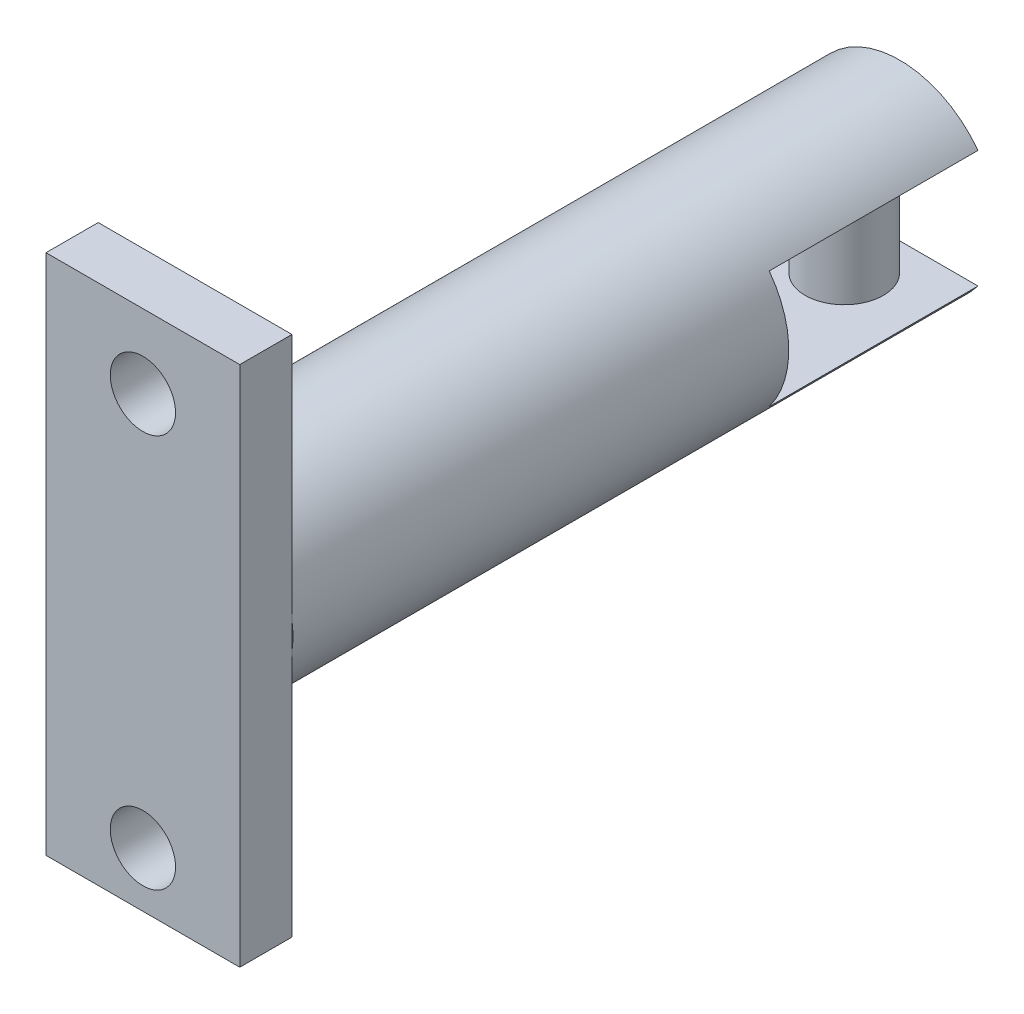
ISO-10303-21;
HEADER;
FILE_DESCRIPTION(('STEP AP214'),'2;1');
FILE_NAME('part.step','',(''),(''),'','','');
FILE_SCHEMA(('AUTOMOTIVE_DESIGN { 1 0 10303 214 1 1 1 1 }'));
ENDSEC;
DATA;
#1=APPLICATION_CONTEXT('core data for automotive mechanical design processes');
#2=APPLICATION_PROTOCOL_DEFINITION('international standard','automotive_design',2000,#1);
#3=PRODUCT_CONTEXT('',#1,'mechanical');
#4=PRODUCT('Part','Part','',(#3));
#5=PRODUCT_RELATED_PRODUCT_CATEGORY('part','',(#4));
#6=PRODUCT_DEFINITION_FORMATION('','',#4);
#7=PRODUCT_DEFINITION_CONTEXT('part definition',#1,'design');
#8=PRODUCT_DEFINITION('design','',#6,#7);
#9=PRODUCT_DEFINITION_SHAPE('','',#8);
#10=(LENGTH_UNIT() NAMED_UNIT(*) SI_UNIT(.MILLI.,.METRE.));
#11=(NAMED_UNIT(*) PLANE_ANGLE_UNIT() SI_UNIT($,.RADIAN.));
#12=(NAMED_UNIT(*) SI_UNIT($,.STERADIAN.) SOLID_ANGLE_UNIT());
#13=UNCERTAINTY_MEASURE_WITH_UNIT(LENGTH_MEASURE(1.E-05),#10,'distance_accuracy_value','');
#14=(GEOMETRIC_REPRESENTATION_CONTEXT(3) GLOBAL_UNCERTAINTY_ASSIGNED_CONTEXT((#13)) GLOBAL_UNIT_ASSIGNED_CONTEXT((#10,
#11,#12)) REPRESENTATION_CONTEXT('',''));
#15=CARTESIAN_POINT('',(0.,0.,0.));
#16=DIRECTION('',(0.,0.,1.));
#17=DIRECTION('',(1.,0.,0.));
#18=AXIS2_PLACEMENT_3D('',#15,#16,#17);
#19=CARTESIAN_POINT('',(0.,0.,54.));
#20=DIRECTION('',(0.,0.,1.));
#21=DIRECTION('',(1.,0.,0.));
#22=AXIS2_PLACEMENT_3D('',#19,#20,#21);
#23=PLANE('',#22);
#24=DIRECTION('',(0.,-1.,0.));
#25=VECTOR('',#24,1.);
#26=CARTESIAN_POINT('',(-7.42498661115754,20.,54.));
#27=LINE('',#26,#25);
#28=CARTESIAN_POINT('',(-7.42498661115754,1.05809915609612,54.));
#29=VERTEX_POINT('',#28);
#30=CARTESIAN_POINT('',(-7.42498661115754,-1.05809915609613,54.));
#31=VERTEX_POINT('',#30);
#32=EDGE_CURVE('E11',#29,#31,#27,.T.);
#33=ORIENTED_EDGE('',*,*,#32,.F.);
#34=CARTESIAN_POINT('',(0.,0.,54.));
#35=DIRECTION('',(0.,0.,1.));
#36=DIRECTION('',(1.,0.,0.));
#37=AXIS2_PLACEMENT_3D('',#34,#35,#36);
#38=CIRCLE('',#37,7.5);
#39=EDGE_CURVE('E187',#29,#31,#38,.T.);
#40=ORIENTED_EDGE('',*,*,#39,.T.);
#41=EDGE_LOOP('',(#33,#40));
#42=FACE_BOUND('',#41,.T.);
#43=ADVANCED_FACE('F39',(#42),#23,.T.);
#44=CARTESIAN_POINT('',(0.,0.,54.));
#45=DIRECTION('',(0.,0.,-1.));
#46=DIRECTION('',(-1.,0.,0.));
#47=AXIS2_PLACEMENT_3D('',#44,#45,#46);
#48=CYLINDRICAL_SURFACE('',#47,7.5);
#49=CARTESIAN_POINT('',(7.42498661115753,1.05809915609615,54.));
#50=VERTEX_POINT('',#49);
#51=EDGE_CURVE('E182',#50,#29,#38,.T.);
#52=ORIENTED_EDGE('',*,*,#51,.F.);
#53=CARTESIAN_POINT('',(7.42498661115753,-1.05809915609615,54.));
#54=VERTEX_POINT('',#53);
#55=EDGE_CURVE('E188',#54,#50,#38,.T.);
#56=ORIENTED_EDGE('',*,*,#55,.F.);
#57=EDGE_CURVE('E64',#31,#54,#38,.T.);
#58=ORIENTED_EDGE('',*,*,#57,.F.);
#59=ORIENTED_EDGE('',*,*,#39,.F.);
#60=EDGE_LOOP('',(#52,#56,#58,#59));
#61=FACE_BOUND('',#60,.T.);
#62=DIRECTION('',(0.,0.,-1.));
#63=VECTOR('',#62,1.);
#64=CARTESIAN_POINT('',(-6.,4.5,54.));
#65=LINE('',#64,#63);
#66=CARTESIAN_POINT('',(-6.,4.5,16.));
#67=VERTEX_POINT('',#66);
#68=CARTESIAN_POINT('',(-6.,4.5,0.));
#69=VERTEX_POINT('',#68);
#70=EDGE_CURVE('E178',#67,#69,#65,.T.);
#71=ORIENTED_EDGE('',*,*,#70,.F.);
#72=CARTESIAN_POINT('',(0.,0.,16.));
#73=DIRECTION('',(0.,0.,1.));
#74=DIRECTION('',(1.,0.,0.));
#75=AXIS2_PLACEMENT_3D('',#72,#73,#74);
#76=CIRCLE('',#75,7.5);
#77=CARTESIAN_POINT('',(-6.,-4.5,16.));
#78=VERTEX_POINT('',#77);
#79=EDGE_CURVE('E200',#67,#78,#76,.T.);
#80=ORIENTED_EDGE('',*,*,#79,.T.);
#81=DIRECTION('',(0.,0.,-1.));
#82=VECTOR('',#81,1.);
#83=CARTESIAN_POINT('',(-6.,-4.5,54.));
#84=LINE('',#83,#82);
#85=CARTESIAN_POINT('',(-6.,-4.5,0.));
#86=VERTEX_POINT('',#85);
#87=EDGE_CURVE('E169',#86,#78,#84,.F.);
#88=ORIENTED_EDGE('',*,*,#87,.F.);
#89=CARTESIAN_POINT('',(0.,0.,0.));
#90=DIRECTION('',(0.,0.,1.));
#91=DIRECTION('',(1.,0.,0.));
#92=AXIS2_PLACEMENT_3D('',#89,#90,#91);
#93=CIRCLE('',#92,7.5);
#94=CARTESIAN_POINT('',(6.,-4.5,0.));
#95=VERTEX_POINT('',#94);
#96=EDGE_CURVE('E181',#86,#95,#93,.T.);
#97=ORIENTED_EDGE('',*,*,#96,.T.);
#98=DIRECTION('',(0.,0.,-1.));
#99=VECTOR('',#98,1.);
#100=CARTESIAN_POINT('',(6.,-4.5,54.));
#101=LINE('',#100,#99);
#102=CARTESIAN_POINT('',(6.,-4.5,16.));
#103=VERTEX_POINT('',#102);
#104=EDGE_CURVE('E172',#103,#95,#101,.T.);
#105=ORIENTED_EDGE('',*,*,#104,.F.);
#106=CARTESIAN_POINT('',(6.,4.5,16.));
#107=VERTEX_POINT('',#106);
#108=EDGE_CURVE('E197',#103,#107,#76,.T.);
#109=ORIENTED_EDGE('',*,*,#108,.T.);
#110=DIRECTION('',(0.,0.,-1.));
#111=VECTOR('',#110,1.);
#112=CARTESIAN_POINT('',(6.,4.5,54.));
#113=LINE('',#112,#111);
#114=CARTESIAN_POINT('',(6.,4.5,0.));
#115=VERTEX_POINT('',#114);
#116=EDGE_CURVE('E175',#115,#107,#113,.F.);
#117=ORIENTED_EDGE('',*,*,#116,.F.);
#118=EDGE_CURVE('E189',#115,#69,#93,.T.);
#119=ORIENTED_EDGE('',*,*,#118,.T.);
#120=EDGE_LOOP('',(#71,#80,#88,#97,#105,#109,#117,#119));
#121=FACE_BOUND('',#120,.T.);
#122=ADVANCED_FACE('F41',(#61,#121),#48,.T.);
#123=CARTESIAN_POINT('',(0.,0.,0.));
#124=DIRECTION('',(0.,0.,1.));
#125=DIRECTION('',(1.,0.,0.));
#126=AXIS2_PLACEMENT_3D('',#123,#124,#125);
#127=PLANE('',#126);
#128=DIRECTION('',(1.,0.,0.));
#129=VECTOR('',#128,1.);
#130=CARTESIAN_POINT('',(0.,4.5,0.));
#131=LINE('',#130,#129);
#132=EDGE_CURVE('E195',#69,#115,#131,.T.);
#133=ORIENTED_EDGE('',*,*,#132,.F.);
#134=ORIENTED_EDGE('',*,*,#118,.F.);
#135=EDGE_LOOP('',(#133,#134));
#136=FACE_BOUND('',#135,.T.);
#137=ADVANCED_FACE('F270',(#136),#127,.F.);
#138=DIRECTION('',(-1.,0.,0.));
#139=VECTOR('',#138,1.);
#140=CARTESIAN_POINT('',(0.,-4.5,0.));
#141=LINE('',#140,#139);
#142=EDGE_CURVE('E186',#95,#86,#141,.T.);
#143=ORIENTED_EDGE('',*,*,#142,.F.);
#144=ORIENTED_EDGE('',*,*,#96,.F.);
#145=EDGE_LOOP('',(#143,#144));
#146=FACE_BOUND('',#145,.T.);
#147=ADVANCED_FACE('F274',(#146),#127,.F.);
#148=DIRECTION('',(0.,1.,0.));
#149=VECTOR('',#148,1.);
#150=CARTESIAN_POINT('',(7.42498661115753,20.,54.));
#151=LINE('',#150,#149);
#152=EDGE_CURVE('E49',#54,#50,#151,.T.);
#153=ORIENTED_EDGE('',*,*,#152,.F.);
#154=ORIENTED_EDGE('',*,*,#55,.T.);
#155=EDGE_LOOP('',(#153,#154));
#156=FACE_BOUND('',#155,.T.);
#157=ADVANCED_FACE('F266',(#156),#23,.T.);
#158=CARTESIAN_POINT('',(0.,0.,16.));
#159=DIRECTION('',(0.,0.,1.));
#160=DIRECTION('',(1.,0.,0.));
#161=AXIS2_PLACEMENT_3D('',#158,#159,#160);
#162=PLANE('',#161);
#163=DIRECTION('',(-1.,0.,0.));
#164=VECTOR('',#163,1.);
#165=CARTESIAN_POINT('',(-8.15127795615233,4.5,16.));
#166=LINE('',#165,#164);
#167=EDGE_CURVE('E161',#107,#67,#166,.T.);
#168=ORIENTED_EDGE('',*,*,#167,.F.);
#169=ORIENTED_EDGE('',*,*,#108,.F.);
#170=DIRECTION('',(1.,0.,0.));
#171=VECTOR('',#170,1.);
#172=CARTESIAN_POINT('',(-8.15127795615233,-4.5,16.));
#173=LINE('',#172,#171);
#174=EDGE_CURVE('E165',#78,#103,#173,.T.);
#175=ORIENTED_EDGE('',*,*,#174,.F.);
#176=ORIENTED_EDGE('',*,*,#79,.F.);
#177=EDGE_LOOP('',(#168,#169,#175,#176));
#178=FACE_BOUND('',#177,.T.);
#179=ADVANCED_FACE('F273',(#178),#162,.F.);
#180=CARTESIAN_POINT('',(-8.15127795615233,4.5,16.));
#181=DIRECTION('',(0.,-1.,0.));
#182=DIRECTION('',(0.,0.,-1.));
#183=AXIS2_PLACEMENT_3D('',#180,#181,#182);
#184=PLANE('',#183);
#185=CARTESIAN_POINT('',(0.,4.5,4.24806538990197));
#186=DIRECTION('',(0.,-1.,0.));
#187=DIRECTION('',(0.,0.,-1.));
#188=AXIS2_PLACEMENT_3D('',#185,#186,#187);
#189=CIRCLE('',#188,3.);
#190=CARTESIAN_POINT('',(0.,4.5,1.24806538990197));
#191=VERTEX_POINT('',#190);
#192=EDGE_CURVE('E151',#191,#191,#189,.T.);
#193=ORIENTED_EDGE('',*,*,#192,.F.);
#194=EDGE_LOOP('',(#193));
#195=FACE_BOUND('',#194,.T.);
#196=ORIENTED_EDGE('',*,*,#70,.T.);
#197=ORIENTED_EDGE('',*,*,#132,.T.);
#198=ORIENTED_EDGE('',*,*,#116,.T.);
#199=ORIENTED_EDGE('',*,*,#167,.T.);
#200=EDGE_LOOP('',(#196,#197,#198,#199));
#201=FACE_BOUND('',#200,.T.);
#202=ADVANCED_FACE('F279',(#195,#201),#184,.T.);
#203=CARTESIAN_POINT('',(-8.15127795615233,-4.5,16.));
#204=DIRECTION('',(0.,1.,0.));
#205=DIRECTION('',(0.,0.,1.));
#206=AXIS2_PLACEMENT_3D('',#203,#204,#205);
#207=PLANE('',#206);
#208=CARTESIAN_POINT('',(0.,-4.5,4.24806538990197));
#209=DIRECTION('',(0.,1.,0.));
#210=DIRECTION('',(0.,0.,1.));
#211=AXIS2_PLACEMENT_3D('',#208,#209,#210);
#212=CIRCLE('',#211,3.);
#213=CARTESIAN_POINT('',(0.,-4.5,7.24806538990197));
#214=VERTEX_POINT('',#213);
#215=EDGE_CURVE('E43',#214,#214,#212,.F.);
#216=ORIENTED_EDGE('',*,*,#215,.T.);
#217=EDGE_LOOP('',(#216));
#218=FACE_BOUND('',#217,.T.);
#219=ORIENTED_EDGE('',*,*,#104,.T.);
#220=ORIENTED_EDGE('',*,*,#142,.T.);
#221=ORIENTED_EDGE('',*,*,#87,.T.);
#222=ORIENTED_EDGE('',*,*,#174,.T.);
#223=EDGE_LOOP('',(#219,#220,#221,#222));
#224=FACE_BOUND('',#223,.T.);
#225=ADVANCED_FACE('F297',(#218,#224),#207,.T.);
#226=CARTESIAN_POINT('',(0.,-6.5,4.24806538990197));
#227=DIRECTION('',(0.,1.,0.));
#228=DIRECTION('',(0.,0.,1.));
#229=AXIS2_PLACEMENT_3D('',#226,#227,#228);
#230=CYLINDRICAL_SURFACE('',#229,3.);
#231=ORIENTED_EDGE('',*,*,#215,.F.);
#232=EDGE_LOOP('',(#231));
#233=FACE_BOUND('',#232,.T.);
#234=ORIENTED_EDGE('',*,*,#192,.T.);
#235=EDGE_LOOP('',(#234));
#236=FACE_BOUND('',#235,.T.);
#237=ADVANCED_FACE('F260',(#233,#236),#230,.T.);
#238=CARTESIAN_POINT('',(0.,0.,54.));
#239=DIRECTION('',(0.,0.,-1.));
#240=DIRECTION('',(-1.,0.,0.));
#241=AXIS2_PLACEMENT_3D('',#238,#239,#240);
#242=PLANE('',#241);
#243=CARTESIAN_POINT('',(0.,14.3420935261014,54.));
#244=DIRECTION('',(0.,0.,1.));
#245=DIRECTION('',(1.,0.,0.));
#246=AXIS2_PLACEMENT_3D('',#243,#244,#245);
#247=CIRCLE('',#246,2.5);
#248=CARTESIAN_POINT('',(2.5,14.3420935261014,54.));
#249=VERTEX_POINT('',#248);
#250=EDGE_CURVE('E239',#249,#249,#247,.T.);
#251=ORIENTED_EDGE('',*,*,#250,.T.);
#252=EDGE_LOOP('',(#251));
#253=FACE_BOUND('',#252,.T.);
#254=CARTESIAN_POINT('',(7.42498661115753,20.,54.));
#255=VERTEX_POINT('',#254);
#256=EDGE_CURVE('E211',#50,#255,#151,.T.);
#257=ORIENTED_EDGE('',*,*,#256,.F.);
#258=ORIENTED_EDGE('',*,*,#51,.T.);
#259=CARTESIAN_POINT('',(-7.42498661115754,20.,54.));
#260=VERTEX_POINT('',#259);
#261=EDGE_CURVE('E51',#260,#29,#27,.T.);
#262=ORIENTED_EDGE('',*,*,#261,.F.);
#263=DIRECTION('',(-1.,0.,0.));
#264=VECTOR('',#263,1.);
#265=CARTESIAN_POINT('',(7.42498661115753,20.,54.));
#266=LINE('',#265,#264);
#267=EDGE_CURVE('E144',#255,#260,#266,.T.);
#268=ORIENTED_EDGE('',*,*,#267,.F.);
#269=EDGE_LOOP('',(#257,#258,#262,#268));
#270=FACE_BOUND('',#269,.T.);
#271=ADVANCED_FACE('F252',(#253,#270),#242,.T.);
#272=CARTESIAN_POINT('',(0.,0.,58.));
#273=DIRECTION('',(0.,0.,-1.));
#274=DIRECTION('',(-1.,0.,0.));
#275=AXIS2_PLACEMENT_3D('',#272,#273,#274);
#276=PLANE('',#275);
#277=DIRECTION('',(0.,-1.,0.));
#278=VECTOR('',#277,1.);
#279=CARTESIAN_POINT('',(-7.42498661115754,20.,58.));
#280=LINE('',#279,#278);
#281=CARTESIAN_POINT('',(-7.42498661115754,20.,58.));
#282=VERTEX_POINT('',#281);
#283=CARTESIAN_POINT('',(-7.42498661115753,-20.,58.));
#284=VERTEX_POINT('',#283);
#285=EDGE_CURVE('E133',#282,#284,#280,.T.);
#286=ORIENTED_EDGE('',*,*,#285,.T.);
#287=DIRECTION('',(1.,0.,0.));
#288=VECTOR('',#287,1.);
#289=CARTESIAN_POINT('',(7.42498661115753,-20.,58.));
#290=LINE('',#289,#288);
#291=CARTESIAN_POINT('',(7.42498661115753,-20.,58.));
#292=VERTEX_POINT('',#291);
#293=EDGE_CURVE('E122',#284,#292,#290,.T.);
#294=ORIENTED_EDGE('',*,*,#293,.T.);
#295=DIRECTION('',(0.,1.,0.));
#296=VECTOR('',#295,1.);
#297=CARTESIAN_POINT('',(7.42498661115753,20.,58.));
#298=LINE('',#297,#296);
#299=CARTESIAN_POINT('',(7.42498661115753,20.,58.));
#300=VERTEX_POINT('',#299);
#301=EDGE_CURVE('E132',#292,#300,#298,.T.);
#302=ORIENTED_EDGE('',*,*,#301,.T.);
#303=DIRECTION('',(-1.,0.,0.));
#304=VECTOR('',#303,1.);
#305=CARTESIAN_POINT('',(7.42498661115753,20.,58.));
#306=LINE('',#305,#304);
#307=EDGE_CURVE('E139',#300,#282,#306,.T.);
#308=ORIENTED_EDGE('',*,*,#307,.T.);
#309=EDGE_LOOP('',(#286,#294,#302,#308));
#310=FACE_BOUND('',#309,.T.);
#311=CARTESIAN_POINT('',(0.,-15.8032773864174,58.));
#312=DIRECTION('',(0.,0.,1.));
#313=DIRECTION('',(1.,0.,0.));
#314=AXIS2_PLACEMENT_3D('',#311,#312,#313);
#315=CIRCLE('',#314,2.5);
#316=CARTESIAN_POINT('',(2.5,-15.8032773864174,58.));
#317=VERTEX_POINT('',#316);
#318=EDGE_CURVE('E234',#317,#317,#315,.T.);
#319=ORIENTED_EDGE('',*,*,#318,.F.);
#320=EDGE_LOOP('',(#319));
#321=FACE_BOUND('',#320,.T.);
#322=CARTESIAN_POINT('',(0.,14.3420935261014,58.));
#323=DIRECTION('',(0.,0.,1.));
#324=DIRECTION('',(1.,0.,0.));
#325=AXIS2_PLACEMENT_3D('',#322,#323,#324);
#326=CIRCLE('',#325,2.5);
#327=CARTESIAN_POINT('',(2.5,14.3420935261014,58.));
#328=VERTEX_POINT('',#327);
#329=EDGE_CURVE('E235',#328,#328,#326,.T.);
#330=ORIENTED_EDGE('',*,*,#329,.F.);
#331=EDGE_LOOP('',(#330));
#332=FACE_BOUND('',#331,.T.);
#333=ADVANCED_FACE('F136',(#310,#321,#332),#276,.F.);
#334=CARTESIAN_POINT('',(0.,-15.8032773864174,54.));
#335=DIRECTION('',(0.,0.,1.));
#336=DIRECTION('',(1.,0.,0.));
#337=AXIS2_PLACEMENT_3D('',#334,#335,#336);
#338=CIRCLE('',#337,2.5);
#339=CARTESIAN_POINT('',(2.5,-15.8032773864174,54.));
#340=VERTEX_POINT('',#339);
#341=EDGE_CURVE('E230',#340,#340,#338,.T.);
#342=ORIENTED_EDGE('',*,*,#341,.T.);
#343=EDGE_LOOP('',(#342));
#344=FACE_BOUND('',#343,.T.);
#345=CARTESIAN_POINT('',(-7.42498661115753,-20.,54.));
#346=VERTEX_POINT('',#345);
#347=EDGE_CURVE('E52',#31,#346,#27,.T.);
#348=ORIENTED_EDGE('',*,*,#347,.F.);
#349=ORIENTED_EDGE('',*,*,#57,.T.);
#350=CARTESIAN_POINT('',(7.42498661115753,-20.,54.));
#351=VERTEX_POINT('',#350);
#352=EDGE_CURVE('E210',#351,#54,#151,.T.);
#353=ORIENTED_EDGE('',*,*,#352,.F.);
#354=DIRECTION('',(1.,0.,0.));
#355=VECTOR('',#354,1.);
#356=CARTESIAN_POINT('',(7.42498661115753,-20.,54.));
#357=LINE('',#356,#355);
#358=EDGE_CURVE('E218',#346,#351,#357,.T.);
#359=ORIENTED_EDGE('',*,*,#358,.F.);
#360=EDGE_LOOP('',(#348,#349,#353,#359));
#361=FACE_BOUND('',#360,.T.);
#362=ADVANCED_FACE('F251',(#344,#361),#242,.T.);
#363=CARTESIAN_POINT('',(-7.42498661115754,20.,58.));
#364=DIRECTION('',(1.,0.,0.));
#365=DIRECTION('',(0.,1.,0.));
#366=AXIS2_PLACEMENT_3D('',#363,#364,#365);
#367=PLANE('',#366);
#368=ORIENTED_EDGE('',*,*,#261,.T.);
#369=ORIENTED_EDGE('',*,*,#32,.T.);
#370=ORIENTED_EDGE('',*,*,#347,.T.);
#371=DIRECTION('',(0.,0.,-1.));
#372=VECTOR('',#371,1.);
#373=CARTESIAN_POINT('',(-7.42498661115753,-20.,58.));
#374=LINE('',#373,#372);
#375=EDGE_CURVE('E126',#284,#346,#374,.T.);
#376=ORIENTED_EDGE('',*,*,#375,.F.);
#377=ORIENTED_EDGE('',*,*,#285,.F.);
#378=DIRECTION('',(0.,0.,-1.));
#379=VECTOR('',#378,1.);
#380=CARTESIAN_POINT('',(-7.42498661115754,20.,58.));
#381=LINE('',#380,#379);
#382=EDGE_CURVE('E227',#282,#260,#381,.T.);
#383=ORIENTED_EDGE('',*,*,#382,.T.);
#384=EDGE_LOOP('',(#368,#369,#370,#376,#377,#383));
#385=FACE_BOUND('',#384,.T.);
#386=ADVANCED_FACE('F147',(#385),#367,.F.);
#387=CARTESIAN_POINT('',(7.42498661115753,-20.,58.));
#388=DIRECTION('',(0.,1.,0.));
#389=DIRECTION('',(-1.,0.,0.));
#390=AXIS2_PLACEMENT_3D('',#387,#388,#389);
#391=PLANE('',#390);
#392=ORIENTED_EDGE('',*,*,#358,.T.);
#393=DIRECTION('',(0.,0.,-1.));
#394=VECTOR('',#393,1.);
#395=CARTESIAN_POINT('',(7.42498661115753,-20.,58.));
#396=LINE('',#395,#394);
#397=EDGE_CURVE('E128',#292,#351,#396,.T.);
#398=ORIENTED_EDGE('',*,*,#397,.F.);
#399=ORIENTED_EDGE('',*,*,#293,.F.);
#400=ORIENTED_EDGE('',*,*,#375,.T.);
#401=EDGE_LOOP('',(#392,#398,#399,#400));
#402=FACE_BOUND('',#401,.T.);
#403=ADVANCED_FACE('F124',(#402),#391,.F.);
#404=CARTESIAN_POINT('',(7.42498661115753,20.,58.));
#405=DIRECTION('',(-1.,0.,0.));
#406=DIRECTION('',(0.,-1.,0.));
#407=AXIS2_PLACEMENT_3D('',#404,#405,#406);
#408=PLANE('',#407);
#409=ORIENTED_EDGE('',*,*,#352,.T.);
#410=ORIENTED_EDGE('',*,*,#152,.T.);
#411=ORIENTED_EDGE('',*,*,#256,.T.);
#412=DIRECTION('',(0.,0.,-1.));
#413=VECTOR('',#412,1.);
#414=CARTESIAN_POINT('',(7.42498661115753,20.,58.));
#415=LINE('',#414,#413);
#416=EDGE_CURVE('E157',#300,#255,#415,.T.);
#417=ORIENTED_EDGE('',*,*,#416,.F.);
#418=ORIENTED_EDGE('',*,*,#301,.F.);
#419=ORIENTED_EDGE('',*,*,#397,.T.);
#420=EDGE_LOOP('',(#409,#410,#411,#417,#418,#419));
#421=FACE_BOUND('',#420,.T.);
#422=ADVANCED_FACE('F319',(#421),#408,.F.);
#423=CARTESIAN_POINT('',(7.42498661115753,20.,58.));
#424=DIRECTION('',(0.,-1.,0.));
#425=DIRECTION('',(1.,0.,0.));
#426=AXIS2_PLACEMENT_3D('',#423,#424,#425);
#427=PLANE('',#426);
#428=ORIENTED_EDGE('',*,*,#267,.T.);
#429=ORIENTED_EDGE('',*,*,#382,.F.);
#430=ORIENTED_EDGE('',*,*,#307,.F.);
#431=ORIENTED_EDGE('',*,*,#416,.T.);
#432=EDGE_LOOP('',(#428,#429,#430,#431));
#433=FACE_BOUND('',#432,.T.);
#434=ADVANCED_FACE('F322',(#433),#427,.F.);
#435=CARTESIAN_POINT('',(0.,-15.8032773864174,58.));
#436=DIRECTION('',(0.,0.,-1.));
#437=DIRECTION('',(-1.,0.,0.));
#438=AXIS2_PLACEMENT_3D('',#435,#436,#437);
#439=CYLINDRICAL_SURFACE('',#438,2.5);
#440=ORIENTED_EDGE('',*,*,#318,.T.);
#441=EDGE_LOOP('',(#440));
#442=FACE_BOUND('',#441,.T.);
#443=ORIENTED_EDGE('',*,*,#341,.F.);
#444=EDGE_LOOP('',(#443));
#445=FACE_BOUND('',#444,.T.);
#446=ADVANCED_FACE('F324',(#442,#445),#439,.F.);
#447=CARTESIAN_POINT('',(0.,14.3420935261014,58.));
#448=DIRECTION('',(0.,0.,-1.));
#449=DIRECTION('',(-1.,0.,0.));
#450=AXIS2_PLACEMENT_3D('',#447,#448,#449);
#451=CYLINDRICAL_SURFACE('',#450,2.5);
#452=ORIENTED_EDGE('',*,*,#329,.T.);
#453=EDGE_LOOP('',(#452));
#454=FACE_BOUND('',#453,.T.);
#455=ORIENTED_EDGE('',*,*,#250,.F.);
#456=EDGE_LOOP('',(#455));
#457=FACE_BOUND('',#456,.T.);
#458=ADVANCED_FACE('F247',(#454,#457),#451,.F.);
#459=CLOSED_SHELL('',(#43,#122,#137,#147,#157,#179,#202,#225,#237,#271,#333,#362,#386,#403,#422,
#434,#446,#458));
#460=MANIFOLD_SOLID_BREP('B2',#459);
#461=ADVANCED_BREP_SHAPE_REPRESENTATION('',(#18,#460),#14);
#462=SHAPE_DEFINITION_REPRESENTATION(#9,#461);
ENDSEC;
END-ISO-10303-21;
